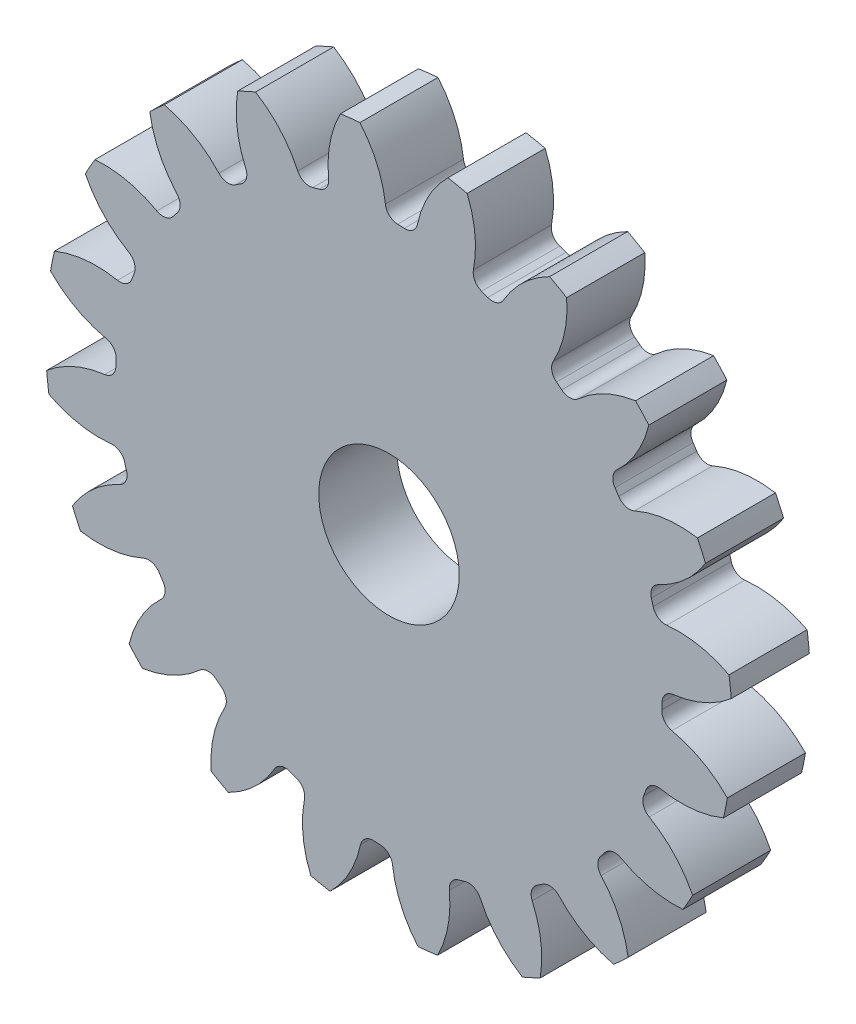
from build123d import *

# Parameters (mm, degrees)
SKETCH3_R         = 558.8
GEARBODY_DEPTH    = 127
TOOTHCUT_DEPTH    = 801.402323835
CIRPATTERN1_COUNT = 20
BOREDIA_R         = 114.3
BORE_DEPTH        = 12700


with BuildPart() as part:
    # Sketch3 → gearBody (new body)
    with BuildSketch(Plane.XY):
        Circle(SKETCH3_R)
    extrude(amount=GEARBODY_DEPTH)

    # Sketch2 → toothCut (cut, through all)
    with BuildSketch(Plane.XY):
        with BuildLine():
            ThreePointArc((443.802384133, -24.893650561), (444.072425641, -19.491813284), (444.276719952, -14.087090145))
            ThreePointArc((444.276719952, -14.087090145), (449.687205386, -0.78620684), (462.455511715, 5.78320735))
            ThreePointArc((462.455511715, 5.78320735), (513.898949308, 20.072245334), (558.8, 48.959950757))
            ThreePointArc((558.8, 48.959950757), (560.401161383, -24.59786776), (552.361181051, -97.732504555))
            ThreePointArc((552.361181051, -97.732504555), (510.163890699, -65.021763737), (460.17027078, -46.280316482))
            ThreePointArc((460.17027078, -46.280316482), (448.026667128, -38.617435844), (443.802384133, -24.893650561))
        make_face()
    toothcut = extrude(amount=TOOTHCUT_DEPTH, mode=Mode.SUBTRACT)

    # CirPattern1: toothCut ×20 about axis
    cirpattern1_axis = Axis((0, 0, 0), (0, 0, 1))
    for i in range(1, CIRPATTERN1_COUNT):
        add(toothcut.rotate(cirpattern1_axis, i * 360 / CIRPATTERN1_COUNT), mode=Mode.SUBTRACT)

    # boreDia → bore (cut, symmetric)
    with BuildSketch(Plane.XY):
        Circle(BOREDIA_R)
    extrude(amount=BORE_DEPTH, both=True, mode=Mode.SUBTRACT)


solid = part.part
